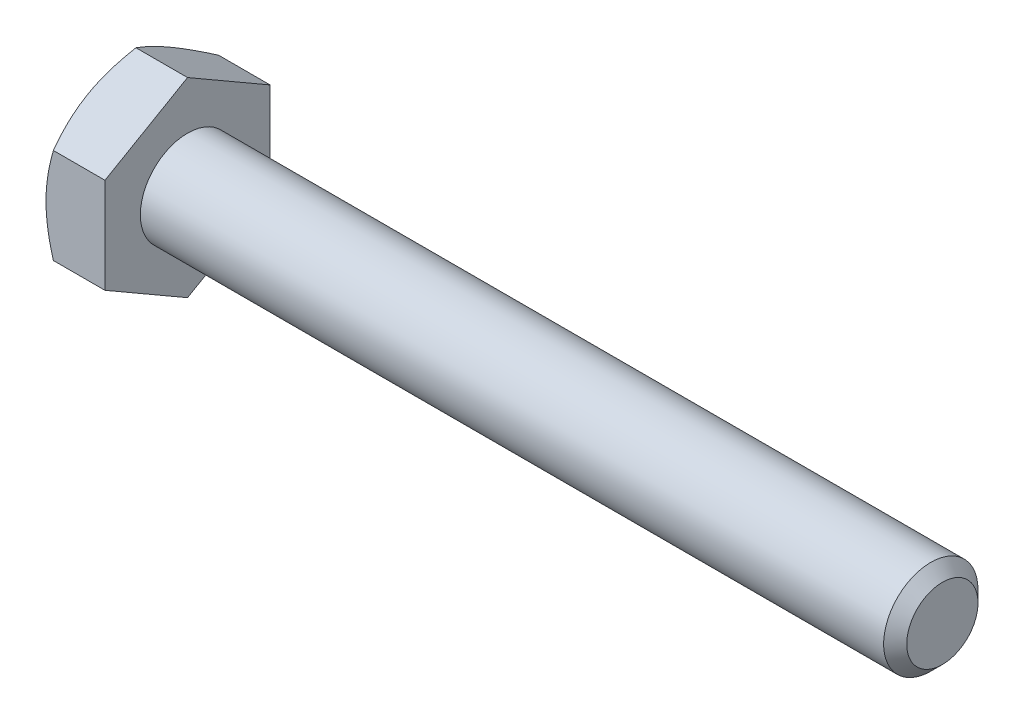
from build123d import *

# Parameters (mm, degrees)
SKETCH5_R           = 3.175
BOSS_EXTRUDE3_DEPTH = 50.8
CHAMFER1_SIZE       = 0.77724
BOSS_EXTRUDE4_DEPTH = 3.96875
SKETCH8_OUTSIDE_W   = 220.032
SKETCH8_OUTSIDE_H   = 221.752
SKETCH8_OUTSIDE_R   = 5.55625
CUT_EXTRUDE3_DEPTH  = 56.422472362
CUT_EXTRUDE3_DRAFT  = -60
CUT_EXTRUDE4_DEPTH  = 0.254
CIRPATTERN1_COUNT   = 3


with BuildPart() as part:
    # Sketch5 → Boss-Extrude3 (new body)
    with BuildSketch(Plane(origin=(27.384375, 0, 0), x_dir=(0, 0, -1), z_dir=(1, 0, 0))):
        Circle(SKETCH5_R)
    extrude(amount=-BOSS_EXTRUDE3_DEPTH)

    # Chamfer1
    chamfer1_edges = [part.edges().sort_by_distance(p)[0] for p in [
        (27.384375, 0, 3.175),
    ]]
    chamfer(chamfer1_edges, length=CHAMFER1_SIZE)

    # Sketch6 → Boss-Extrude4 (add)
    with BuildSketch(Plane.ZY.offset(23.415625)):
        Polygon((5.55625, 3.207902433), (0, 6.415804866), (-5.55625, 3.207902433), (-5.55625, -3.207902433), (0, -6.415804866), (5.55625, -3.207902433), align=None)
    extrude(amount=BOSS_EXTRUDE4_DEPTH)


with BuildPart() as cut_extrude3_tool:
    # Sketch8 outside → Cut-Extrude3 (with draft: the straight prism first)
    with BuildSketch(Plane.ZY.offset(27.384375)):
        Rectangle(SKETCH8_OUTSIDE_W, SKETCH8_OUTSIDE_H)
        Circle(SKETCH8_OUTSIDE_R, mode=Mode.SUBTRACT)
    extrude(amount=-CUT_EXTRUDE3_DEPTH)
    # Cut-Extrude3: the draft: its side faces are tilted about the plane it starts from
    cut_extrude3_sides = [cut_extrude3_tool.faces().sort_by_distance(p)[0] for p in [
        (0.826861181, -110.876, 0),
        (0.826861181, 0, 110.016),
        (0.826861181, 110.876, 0),
        (0.826861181, 0, -110.016),
        (0.826861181, 0, -5.55625),
    ]]
    draft(cut_extrude3_sides, Plane.ZY.offset(27.384375), CUT_EXTRUDE3_DRAFT)


with BuildPart() as part_1:
    add(part.part)

    # Cut-Extrude3: cut by cut_extrude3_tool
    add(cut_extrude3_tool.part, mode=Mode.SUBTRACT)

    # Sketch12 → Cut-Extrude4 (cut)
    with BuildSketch(Plane.ZY.offset(27.384375)):
        with BuildLine():
            Line((0.1666875, 4.2783125), (0.1666875, 2.3891875))
            ThreePointArc((0.1666875, 2.3891875), (0, 2.2225), (-0.1666875, 2.3891875))
            Line((-0.1666875, 2.3891875), (-0.1666875, 4.2783125))
            ThreePointArc((-0.1666875, 4.2783125), (0, 4.445), (0.1666875, 4.2783125))
        make_face()
    cut_extrude4 = extrude(amount=-CUT_EXTRUDE4_DEPTH, mode=Mode.SUBTRACT)

    # CirPattern1: Cut-Extrude4 ×3 about axis
    cirpattern1_axis = Axis((0, 0, 0), (1, 0, 0))
    for i in range(1, CIRPATTERN1_COUNT):
        add(cut_extrude4.rotate(cirpattern1_axis, i * 360 / CIRPATTERN1_COUNT), mode=Mode.SUBTRACT)


solid = part_1.part
